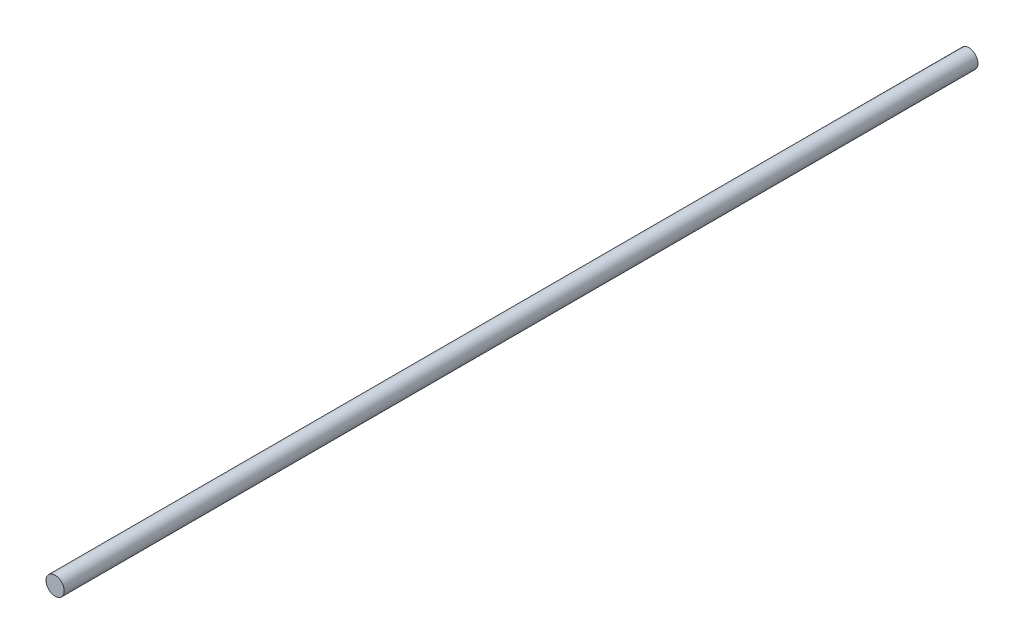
from build123d import *

# Parameters (mm, degrees)
SKETCH1_R           = 10
BOSS_EXTRUDE1_DEPTH = 1000


with BuildPart() as part:
    # Sketch1 → Boss-Extrude1 (new body)
    with BuildSketch(Plane.XY):
        Circle(SKETCH1_R)
    extrude(amount=BOSS_EXTRUDE1_DEPTH)


solid = part.part
